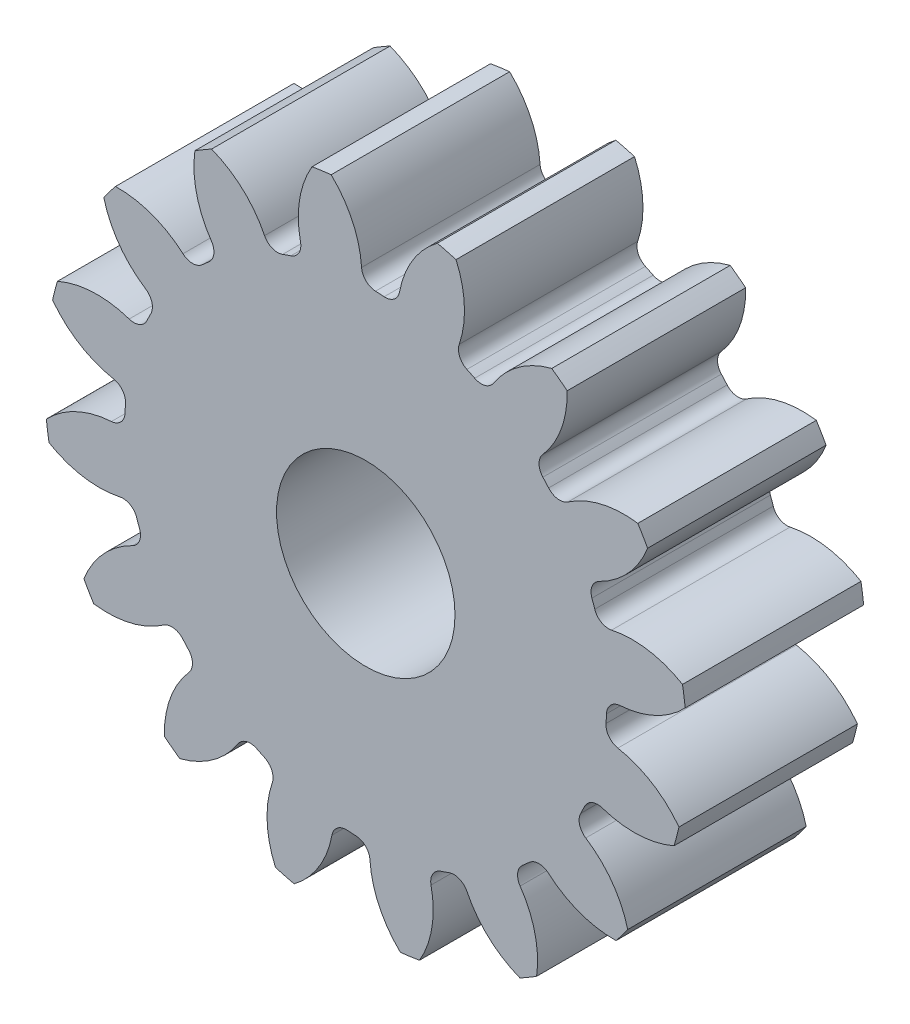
from build123d import *

# Parameters (mm, degrees)
SKETCH3_R         = 182.88
GEARBODY_DEPTH    = 101.6
TOOTHCUT_DEPTH    = 278.87182081
CIRPATTERN1_COUNT = 16
BOREDIA_R         = 50.8
BORE_DEPTH        = 12700


with BuildPart() as part:
    # Sketch3 → gearBody (new body)
    with BuildSketch(Plane.XY):
        Circle(SKETCH3_R)
    extrude(amount=GEARBODY_DEPTH)

    # Sketch2 → toothCut (cut, through all)
    with BuildSketch(Plane.XY):
        with BuildLine():
            ThreePointArc((136.760001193, -10.467457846), (136.926050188, -8.007645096), (137.047859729, -5.545245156))
            ThreePointArc((137.047859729, -5.545245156), (139.392249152, -0.103682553), (144.774790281, 2.373213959))
            ThreePointArc((144.774790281, 2.373213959), (165.632317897, 7.877804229), (182.88, 20.833669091))
            ThreePointArc((182.88, 20.833669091), (183.748908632, -10.74591756), (179.204867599, -42.008946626))
            ThreePointArc((179.204867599, -42.008946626), (163.584953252, -27.130934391), (143.511247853, -19.232622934))
            ThreePointArc((143.511247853, -19.232622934), (138.45411674, -16.145198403), (136.760001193, -10.467457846))
        make_face()
    toothcut = extrude(amount=TOOTHCUT_DEPTH, mode=Mode.SUBTRACT)

    # CirPattern1: toothCut ×16 about axis
    cirpattern1_axis = Axis((0, 0, 0), (0, 0, 1))
    for i in range(1, CIRPATTERN1_COUNT):
        add(toothcut.rotate(cirpattern1_axis, i * 360 / CIRPATTERN1_COUNT), mode=Mode.SUBTRACT)

    # boreDia → bore (cut, symmetric)
    with BuildSketch(Plane.XY):
        Circle(BOREDIA_R)
    extrude(amount=BORE_DEPTH, both=True, mode=Mode.SUBTRACT)


solid = part.part
